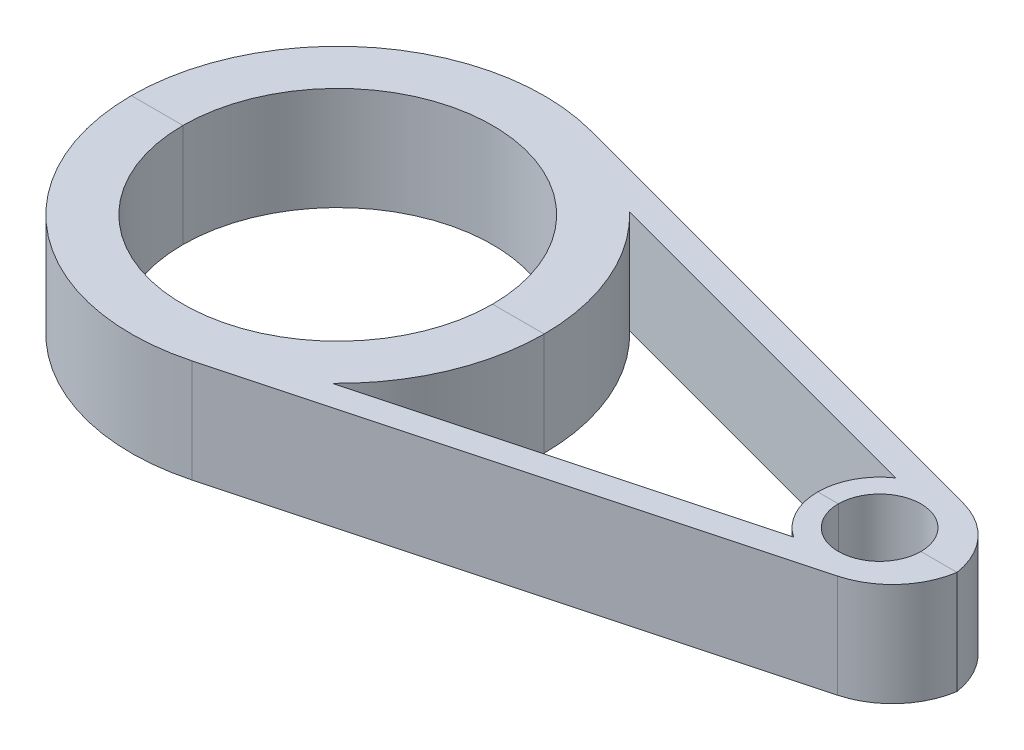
from build123d import *

# Parameters (mm, degrees)
EXTRUDE1_DEPTH     = 20
CUT_EXTRUDE1_DEPTH = 129.062484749


with BuildPart() as part:
    # Sketch2 → Extrude1 (new body)
    with BuildSketch(Plane(origin=(0, 0, 0), x_dir=(1, 0, 0), z_dir=(0, 1, 0))):
        with BuildLine():
            Line((10.352761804, 38.637033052), (109.059714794, 12.188584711))
            ThreePointArc((109.059714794, 12.188584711), (116.340238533, 7.719262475), (120, 0))
            Line((120, 0), (113, 0))
            ThreePointArc((113, 0), (105, 8), (97, 0))
            Line((97, 0), (30, 0))
            ThreePointArc((30, 0), (0, 30), (-30, 0))
            Line((-30, 0), (-40, 0))
            ThreePointArc((-40, 0), (-24.35045716, 31.734133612), (10.352761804, 38.637033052))
        make_face()
    extrude(amount=EXTRUDE1_DEPTH)

    # Sketch3 → Cut-Extrude1 (cut, through all)
    with BuildSketch(Plane(origin=(0, 20, 0), x_dir=(-1, 0, 0), z_dir=(0, 1, 0))):
        with BuildLine():
            Line((-98.236401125, -9.912301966), (-27.763739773, -28.795394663))
            ThreePointArc((-27.763739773, -28.795394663), (-36.814057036, -15.643695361), (-40, 0))
            Line((-40, 0), (-93, 0))
            ThreePointArc((-93, 0), (-94.389552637, -5.605212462), (-98.236401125, -9.912301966))
        make_face()
    extrude(amount=-CUT_EXTRUDE1_DEPTH, mode=Mode.SUBTRACT)


with BuildPart() as body_2:
    # Mirror1: mirrored copy
    add(part.part.mirror(Plane(origin=(97, 20, 0), x_dir=(1, 0, 0), z_dir=(0, 0, -1))))


solid = Compound([part.part, body_2.part])
